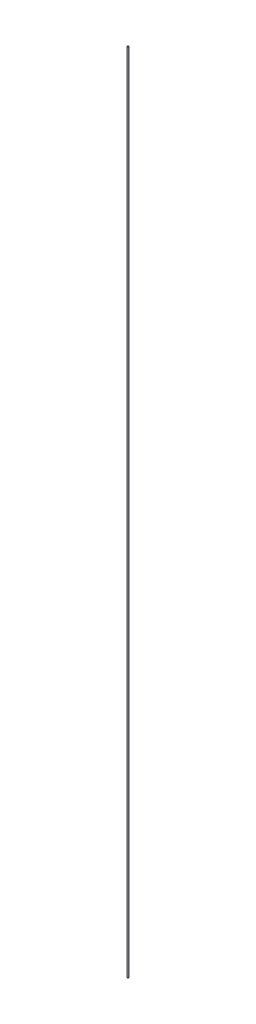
ISO-10303-21;
HEADER;
FILE_DESCRIPTION(('STEP AP214'),'2;1');
FILE_NAME('part.step','',(''),(''),'','','');
FILE_SCHEMA(('AUTOMOTIVE_DESIGN { 1 0 10303 214 1 1 1 1 }'));
ENDSEC;
DATA;
#1=APPLICATION_CONTEXT('core data for automotive mechanical design processes');
#2=APPLICATION_PROTOCOL_DEFINITION('international standard','automotive_design',2000,#1);
#3=PRODUCT_CONTEXT('',#1,'mechanical');
#4=PRODUCT('Part','Part','',(#3));
#5=PRODUCT_RELATED_PRODUCT_CATEGORY('part','',(#4));
#6=PRODUCT_DEFINITION_FORMATION('','',#4);
#7=PRODUCT_DEFINITION_CONTEXT('part definition',#1,'design');
#8=PRODUCT_DEFINITION('design','',#6,#7);
#9=PRODUCT_DEFINITION_SHAPE('','',#8);
#10=(LENGTH_UNIT() NAMED_UNIT(*) SI_UNIT(.MILLI.,.METRE.));
#11=(NAMED_UNIT(*) PLANE_ANGLE_UNIT() SI_UNIT($,.RADIAN.));
#12=(NAMED_UNIT(*) SI_UNIT($,.STERADIAN.) SOLID_ANGLE_UNIT());
#13=UNCERTAINTY_MEASURE_WITH_UNIT(LENGTH_MEASURE(1.E-05),#10,'distance_accuracy_value','');
#14=(GEOMETRIC_REPRESENTATION_CONTEXT(3) GLOBAL_UNCERTAINTY_ASSIGNED_CONTEXT((#13)) GLOBAL_UNIT_ASSIGNED_CONTEXT((#10,
#11,#12)) REPRESENTATION_CONTEXT('',''));
#15=CARTESIAN_POINT('',(0.,0.,0.));
#16=DIRECTION('',(0.,0.,1.));
#17=DIRECTION('',(1.,0.,0.));
#18=AXIS2_PLACEMENT_3D('',#15,#16,#17);
#19=CARTESIAN_POINT('',(0.,1880.,0.));
#20=DIRECTION('',(0.,-1.,0.));
#21=DIRECTION('',(0.,0.,-1.));
#22=AXIS2_PLACEMENT_3D('',#19,#20,#21);
#23=CYLINDRICAL_SURFACE('',#22,1.5);
#24=CARTESIAN_POINT('',(0.,1880.,0.));
#25=DIRECTION('',(0.,1.,0.));
#26=DIRECTION('',(0.,0.,1.));
#27=AXIS2_PLACEMENT_3D('',#24,#25,#26);
#28=CIRCLE('',#27,1.5);
#29=CARTESIAN_POINT('',(0.,1880.,-1.5));
#30=VERTEX_POINT('',#29);
#31=EDGE_CURVE('E10',#30,#30,#28,.T.);
#32=CARTESIAN_POINT('',(0.,0.,0.));
#33=DIRECTION('',(0.,1.,0.));
#34=DIRECTION('',(0.,0.,1.));
#35=AXIS2_PLACEMENT_3D('',#32,#33,#34);
#36=CIRCLE('',#35,1.5);
#37=CARTESIAN_POINT('',(0.,-2.22044604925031E-13,-1.5));
#38=VERTEX_POINT('',#37);
#39=EDGE_CURVE('E33',#38,#38,#36,.T.);
#40=CARTESIAN_POINT('',(0.,1880.,-1.5));
#41=CARTESIAN_POINT('',(0.,1860.41666666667,-1.5));
#42=CARTESIAN_POINT('',(0.,1840.83333333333,-1.5));
#43=CARTESIAN_POINT('',(0.,1801.66666666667,-1.5));
#44=CARTESIAN_POINT('',(0.,1782.08333333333,-1.5));
#45=CARTESIAN_POINT('',(0.,1742.91666666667,-1.5));
#46=CARTESIAN_POINT('',(0.,1723.33333333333,-1.5));
#47=CARTESIAN_POINT('',(0.,1684.16666666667,-1.5));
#48=CARTESIAN_POINT('',(0.,1664.58333333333,-1.5));
#49=CARTESIAN_POINT('',(0.,1625.41666666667,-1.5));
#50=CARTESIAN_POINT('',(0.,1605.83333333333,-1.5));
#51=CARTESIAN_POINT('',(0.,1566.66666666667,-1.5));
#52=CARTESIAN_POINT('',(0.,1547.08333333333,-1.5));
#53=CARTESIAN_POINT('',(0.,1507.91666666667,-1.5));
#54=CARTESIAN_POINT('',(0.,1488.33333333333,-1.5));
#55=CARTESIAN_POINT('',(0.,1449.16666666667,-1.5));
#56=CARTESIAN_POINT('',(0.,1429.58333333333,-1.5));
#57=CARTESIAN_POINT('',(0.,1390.41666666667,-1.5));
#58=CARTESIAN_POINT('',(0.,1370.83333333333,-1.5));
#59=CARTESIAN_POINT('',(0.,1331.66666666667,-1.5));
#60=CARTESIAN_POINT('',(0.,1312.08333333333,-1.5));
#61=CARTESIAN_POINT('',(0.,1272.91666666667,-1.5));
#62=CARTESIAN_POINT('',(0.,1253.33333333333,-1.5));
#63=CARTESIAN_POINT('',(0.,1214.16666666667,-1.5));
#64=CARTESIAN_POINT('',(0.,1194.58333333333,-1.5));
#65=CARTESIAN_POINT('',(0.,1155.41666666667,-1.5));
#66=CARTESIAN_POINT('',(0.,1135.83333333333,-1.5));
#67=CARTESIAN_POINT('',(0.,1096.66666666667,-1.5));
#68=CARTESIAN_POINT('',(0.,1077.08333333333,-1.5));
#69=CARTESIAN_POINT('',(0.,1037.91666666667,-1.5));
#70=CARTESIAN_POINT('',(0.,1018.33333333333,-1.5));
#71=CARTESIAN_POINT('',(0.,979.166666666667,-1.5));
#72=CARTESIAN_POINT('',(0.,959.583333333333,-1.5));
#73=CARTESIAN_POINT('',(0.,920.416666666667,-1.5));
#74=CARTESIAN_POINT('',(0.,900.833333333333,-1.5));
#75=CARTESIAN_POINT('',(0.,861.666666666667,-1.5));
#76=CARTESIAN_POINT('',(0.,842.083333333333,-1.5));
#77=CARTESIAN_POINT('',(0.,802.916666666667,-1.5));
#78=CARTESIAN_POINT('',(0.,783.333333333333,-1.5));
#79=CARTESIAN_POINT('',(0.,744.166666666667,-1.5));
#80=CARTESIAN_POINT('',(0.,724.583333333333,-1.5));
#81=CARTESIAN_POINT('',(0.,685.416666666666,-1.5));
#82=CARTESIAN_POINT('',(0.,665.833333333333,-1.5));
#83=CARTESIAN_POINT('',(0.,626.666666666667,-1.5));
#84=CARTESIAN_POINT('',(0.,607.083333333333,-1.5));
#85=CARTESIAN_POINT('',(0.,567.916666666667,-1.5));
#86=CARTESIAN_POINT('',(0.,548.333333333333,-1.5));
#87=CARTESIAN_POINT('',(0.,509.166666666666,-1.5));
#88=CARTESIAN_POINT('',(0.,489.583333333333,-1.5));
#89=CARTESIAN_POINT('',(0.,450.416666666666,-1.5));
#90=CARTESIAN_POINT('',(0.,430.833333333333,-1.5));
#91=CARTESIAN_POINT('',(0.,391.666666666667,-1.5));
#92=CARTESIAN_POINT('',(0.,372.083333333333,-1.5));
#93=CARTESIAN_POINT('',(0.,332.916666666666,-1.5));
#94=CARTESIAN_POINT('',(0.,313.333333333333,-1.5));
#95=CARTESIAN_POINT('',(0.,274.166666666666,-1.5));
#96=CARTESIAN_POINT('',(0.,254.583333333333,-1.5));
#97=CARTESIAN_POINT('',(0.,215.416666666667,-1.5));
#98=CARTESIAN_POINT('',(0.,195.833333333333,-1.5));
#99=CARTESIAN_POINT('',(0.,156.666666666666,-1.5));
#100=CARTESIAN_POINT('',(0.,137.083333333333,-1.5));
#101=CARTESIAN_POINT('',(0.,97.9166666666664,-1.5));
#102=CARTESIAN_POINT('',(0.,78.3333333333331,-1.5));
#103=CARTESIAN_POINT('',(0.,39.1666666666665,-1.5));
#104=CARTESIAN_POINT('',(0.,19.5833333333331,-1.5));
#105=CARTESIAN_POINT('',(0.,-2.22044604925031E-13,-1.5));
#106=B_SPLINE_CURVE_WITH_KNOTS('',3,(#40,#41,#42,#43,#44,#45,#46,#47,#48,#49,#50,#51,#52,#53,
#54,#55,#56,#57,#58,#59,#60,#61,#62,#63,#64,#65,#66,#67,#68,#69,#70,#71,#72,#73,#74,#75,#76,#77,
#78,#79,#80,#81,#82,#83,#84,#85,#86,#87,#88,#89,#90,#91,#92,#93,#94,#95,#96,#97,#98,#99,#100,
#101,#102,#103,#104,#105),.UNSPECIFIED.,.F.,.F.,(4,2,2,2,2,2,2,2,2,2,2,2,2,2,2,2,2,2,2,2,2,2,2,
2,2,2,2,2,2,2,2,2,4),(0.,58.7499999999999,117.5,176.25,235.,293.75,352.5,411.25,470.,528.75,
587.5,646.25,705.,763.75,822.5,881.25,940.,998.75,1057.5,1116.25,1175.,1233.75,1292.5,1351.25,
1410.,1468.75,1527.5,1586.25,1645.,1703.75,1762.5,1821.25,1880.),.UNSPECIFIED.);
#107=EDGE_CURVE('BSEAM30',#30,#38,#106,.T.);
#108=ORIENTED_EDGE('',*,*,#31,.F.);
#109=ORIENTED_EDGE('',*,*,#39,.T.);
#110=ORIENTED_EDGE('',*,*,#107,.T.);
#111=ORIENTED_EDGE('',*,*,#107,.F.);
#112=EDGE_LOOP('',(#108,#110,#109,#111));
#113=FACE_BOUND('',#112,.T.);
#114=ADVANCED_FACE('F30',(#113),#23,.T.);
#115=CARTESIAN_POINT('',(0.,1880.,0.));
#116=DIRECTION('',(0.,1.,0.));
#117=DIRECTION('',(0.,0.,1.));
#118=AXIS2_PLACEMENT_3D('',#115,#116,#117);
#119=PLANE('',#118);
#120=ORIENTED_EDGE('',*,*,#31,.T.);
#121=EDGE_LOOP('',(#120));
#122=FACE_BOUND('',#121,.T.);
#123=ADVANCED_FACE('F45',(#122),#119,.T.);
#124=CARTESIAN_POINT('',(0.,0.,0.));
#125=DIRECTION('',(0.,1.,0.));
#126=DIRECTION('',(0.,0.,1.));
#127=AXIS2_PLACEMENT_3D('',#124,#125,#126);
#128=PLANE('',#127);
#129=ORIENTED_EDGE('',*,*,#39,.F.);
#130=EDGE_LOOP('',(#129));
#131=FACE_BOUND('',#130,.T.);
#132=ADVANCED_FACE('F43',(#131),#128,.F.);
#133=CLOSED_SHELL('',(#114,#123,#132));
#134=MANIFOLD_SOLID_BREP('B2',#133);
#135=ADVANCED_BREP_SHAPE_REPRESENTATION('',(#18,#134),#14);
#136=SHAPE_DEFINITION_REPRESENTATION(#9,#135);
ENDSEC;
END-ISO-10303-21;
